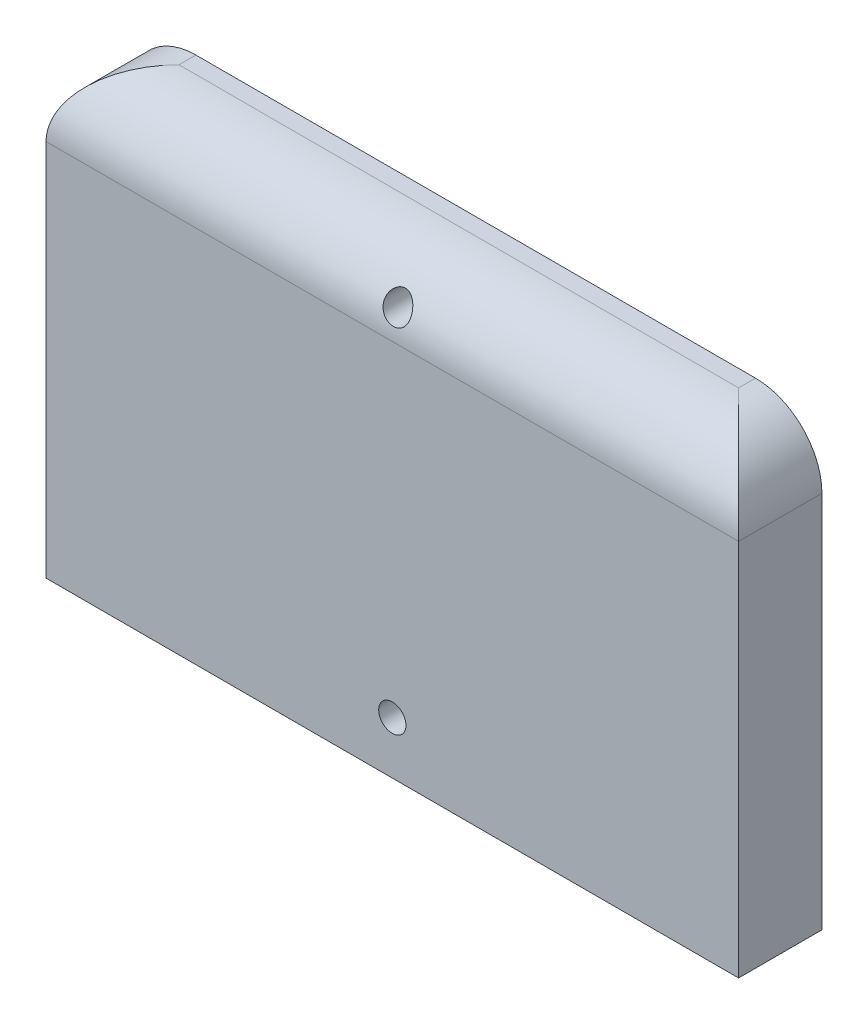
from build123d import *

# Parameters (mm, degrees)
BOSS_EXTRUDE1_DEPTH      = 2.54
BOSS_EXTRUDE1_DEPTH_BACK = 5.104249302
SKETCH1_W                = 63.5
SKETCH1_H                = 40.767
FILLET1_R                = 6.096
HOLE3_D                  = 2.5


with BuildPart() as part:
    # Sketch1 → Boss-Extrude1 (new, two sides: drawn at the far end of the back side and taken through both)
    with BuildSketch(Plane.XY.offset(-BOSS_EXTRUDE1_DEPTH_BACK)):
        Rectangle(SKETCH1_W, SKETCH1_H)
    extrude(amount=BOSS_EXTRUDE1_DEPTH + BOSS_EXTRUDE1_DEPTH_BACK)

    # Fillet1
    fillet1_edges = [part.edges().sort_by_distance(p)[0] for p in [
        (0, 20.3835, 2.54),
        (-31.75, 20.3835, -1.282124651),
        (31.75, 20.3835, -1.282124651),
    ]]
    fillet(fillet1_edges, radius=FILLET1_R)

    # Hole3 (through all)
    with Locations(Plane.XY.offset(2.54)):
        with Locations((0, -15.58363192), (0, 16.67436808)):
            Hole(HOLE3_D / 2)


solid = part.part
